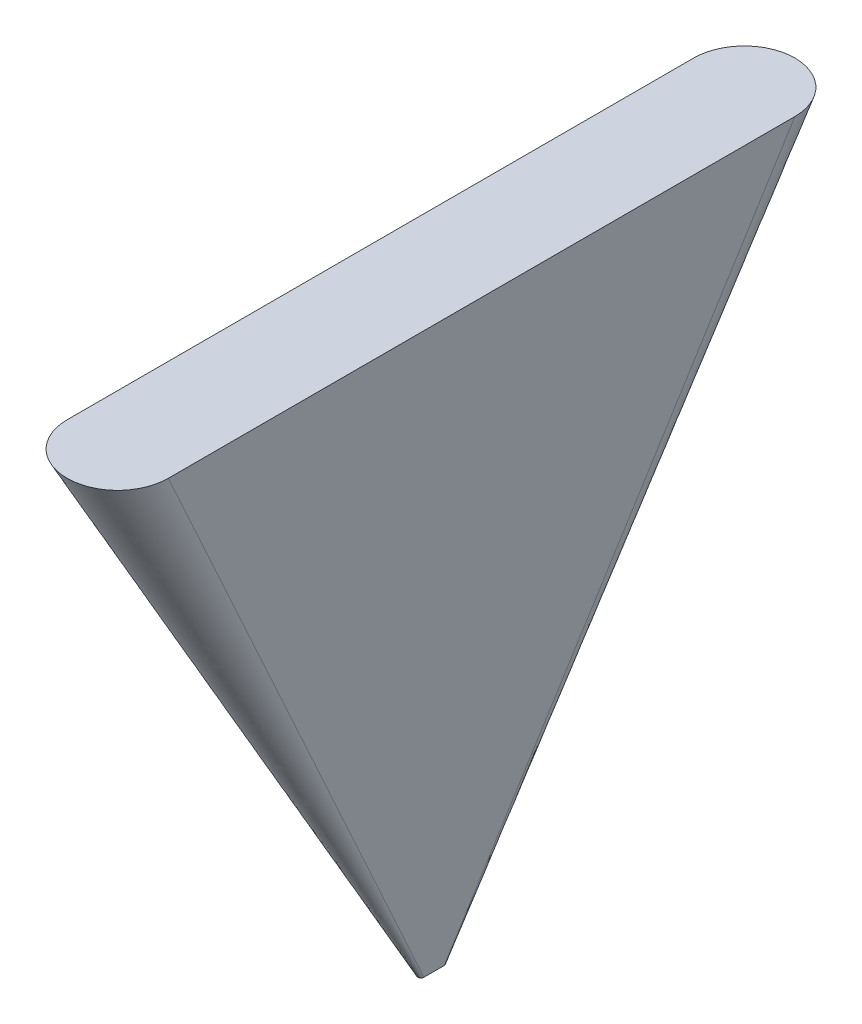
from build123d import *


with BuildPart() as part:
    # Schizzo2 → Loft1 section 0
    with BuildSketch(Plane(origin=(0, 0, 0), x_dir=(1, 0, 0), z_dir=(0, 1, 0))):
        with BuildLine():
            Line((-1.5, -5), (-1.5, 5))
            ThreePointArc((-1.5, 5), (0, 6.5), (1.5, 5))
            Line((1.5, 5), (1.5, -5))
            ThreePointArc((1.5, -5), (0, -6.5), (-1.5, -5))
        make_face()
    # Schizzo4 → Loft1 section 1
    with BuildSketch(Plane(origin=(0, 300, 0), x_dir=(-1, 0, 0), z_dir=(0, 1, 0))):
        with BuildLine():
            Line((25, 154.705080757), (25, -154.705080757))
            ThreePointArc((25, -154.705080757), (0, -179.705080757), (-25, -154.705080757))
            Line((-25, -154.705080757), (-25, 154.705080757))
            ThreePointArc((-25, 154.705080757), (0, 179.705080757), (25, 154.705080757))
        make_face()
    loft()


solid = part.part
